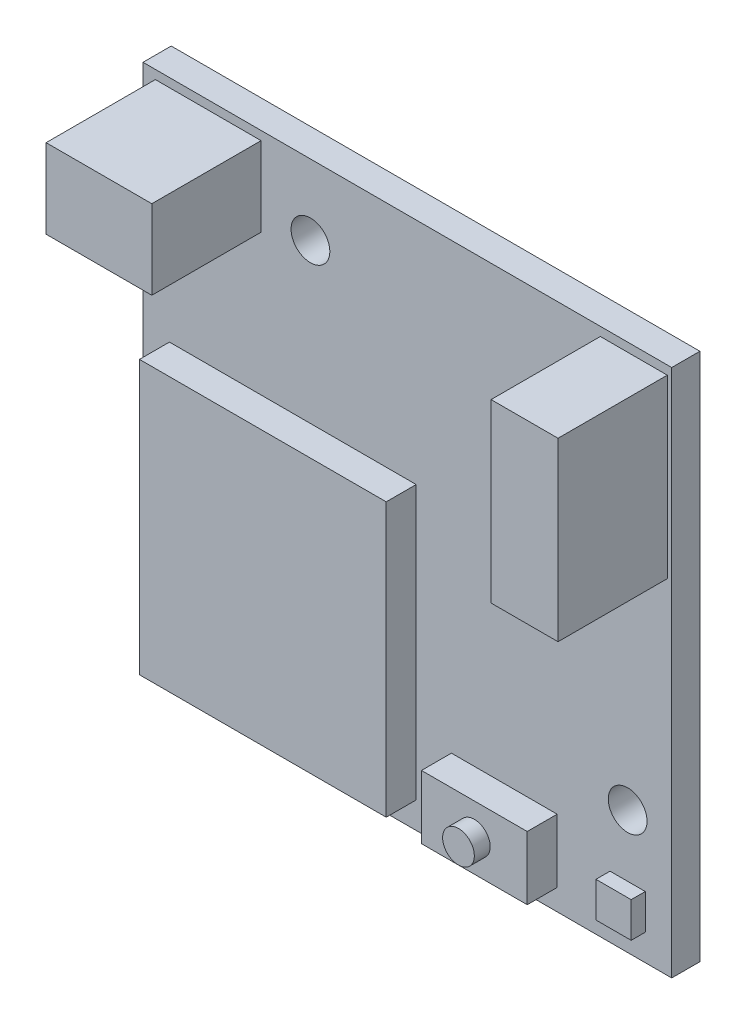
ISO-10303-21;
HEADER;
FILE_DESCRIPTION(('STEP AP214'),'2;1');
FILE_NAME('part.step','',(''),(''),'','','');
FILE_SCHEMA(('AUTOMOTIVE_DESIGN { 1 0 10303 214 1 1 1 1 }'));
ENDSEC;
DATA;
#1=APPLICATION_CONTEXT('core data for automotive mechanical design processes');
#2=APPLICATION_PROTOCOL_DEFINITION('international standard','automotive_design',2000,#1);
#3=PRODUCT_CONTEXT('',#1,'mechanical');
#4=PRODUCT('Part','Part','',(#3));
#5=PRODUCT_RELATED_PRODUCT_CATEGORY('part','',(#4));
#6=PRODUCT_DEFINITION_FORMATION('','',#4);
#7=PRODUCT_DEFINITION_CONTEXT('part definition',#1,'design');
#8=PRODUCT_DEFINITION('design','',#6,#7);
#9=PRODUCT_DEFINITION_SHAPE('','',#8);
#10=(LENGTH_UNIT() NAMED_UNIT(*) SI_UNIT(.MILLI.,.METRE.));
#11=(NAMED_UNIT(*) PLANE_ANGLE_UNIT() SI_UNIT($,.RADIAN.));
#12=(NAMED_UNIT(*) SI_UNIT($,.STERADIAN.) SOLID_ANGLE_UNIT());
#13=UNCERTAINTY_MEASURE_WITH_UNIT(LENGTH_MEASURE(1.E-05),#10,'distance_accuracy_value','');
#14=(GEOMETRIC_REPRESENTATION_CONTEXT(3) GLOBAL_UNCERTAINTY_ASSIGNED_CONTEXT((#13)) GLOBAL_UNIT_ASSIGNED_CONTEXT((#10,
#11,#12)) REPRESENTATION_CONTEXT('',''));
#15=CARTESIAN_POINT('',(0.,0.,0.));
#16=DIRECTION('',(0.,0.,1.));
#17=DIRECTION('',(1.,0.,0.));
#18=AXIS2_PLACEMENT_3D('',#15,#16,#17);
#19=CARTESIAN_POINT('',(0.,0.,1.6));
#20=DIRECTION('',(0.,0.,-1.));
#21=DIRECTION('',(-1.,0.,0.));
#22=AXIS2_PLACEMENT_3D('',#19,#20,#21);
#23=PLANE('',#22);
#24=DIRECTION('',(0.,-1.,0.));
#25=VECTOR('',#24,1.);
#26=CARTESIAN_POINT('',(-14.3,14.5,1.6));
#27=LINE('',#26,#25);
#28=CARTESIAN_POINT('',(-14.3,14.5,1.6));
#29=VERTEX_POINT('',#28);
#30=CARTESIAN_POINT('',(-14.3,10.,1.6));
#31=VERTEX_POINT('',#30);
#32=EDGE_CURVE('E217',#29,#31,#27,.T.);
#33=ORIENTED_EDGE('',*,*,#32,.F.);
#34=DIRECTION('',(-1.,0.,0.));
#35=VECTOR('',#34,1.);
#36=CARTESIAN_POINT('',(-14.3,14.5,1.6));
#37=LINE('',#36,#35);
#38=CARTESIAN_POINT('',(-8.3,14.5,1.6));
#39=VERTEX_POINT('',#38);
#40=EDGE_CURVE('E260',#39,#29,#37,.T.);
#41=ORIENTED_EDGE('',*,*,#40,.F.);
#42=DIRECTION('',(0.,1.,0.));
#43=VECTOR('',#42,1.);
#44=CARTESIAN_POINT('',(-8.3,14.5,1.6));
#45=LINE('',#44,#43);
#46=CARTESIAN_POINT('',(-8.3,10.,1.6));
#47=VERTEX_POINT('',#46);
#48=EDGE_CURVE('E277',#47,#39,#45,.T.);
#49=ORIENTED_EDGE('',*,*,#48,.F.);
#50=DIRECTION('',(1.,0.,0.));
#51=VECTOR('',#50,1.);
#52=CARTESIAN_POINT('',(-14.3,10.,1.6));
#53=LINE('',#52,#51);
#54=EDGE_CURVE('E273',#31,#47,#53,.T.);
#55=ORIENTED_EDGE('',*,*,#54,.F.);
#56=EDGE_LOOP('',(#33,#41,#49,#55));
#57=FACE_BOUND('',#56,.T.);
#58=DIRECTION('',(0.,-1.,0.));
#59=VECTOR('',#58,1.);
#60=CARTESIAN_POINT('',(11.5,-11.5,1.6));
#61=LINE('',#60,#59);
#62=CARTESIAN_POINT('',(11.5,-11.5,1.6));
#63=VERTEX_POINT('',#62);
#64=CARTESIAN_POINT('',(11.5,-13.5,1.6));
#65=VERTEX_POINT('',#64);
#66=EDGE_CURVE('E344',#63,#65,#61,.T.);
#67=ORIENTED_EDGE('',*,*,#66,.F.);
#68=DIRECTION('',(-1.,0.,0.));
#69=VECTOR('',#68,1.);
#70=CARTESIAN_POINT('',(11.5,-11.5,1.6));
#71=LINE('',#70,#69);
#72=CARTESIAN_POINT('',(13.5,-11.5,1.6));
#73=VERTEX_POINT('',#72);
#74=EDGE_CURVE('E350',#73,#63,#71,.T.);
#75=ORIENTED_EDGE('',*,*,#74,.F.);
#76=DIRECTION('',(0.,1.,0.));
#77=VECTOR('',#76,1.);
#78=CARTESIAN_POINT('',(13.5,-11.5,1.6));
#79=LINE('',#78,#77);
#80=CARTESIAN_POINT('',(13.5,-13.5,1.6));
#81=VERTEX_POINT('',#80);
#82=EDGE_CURVE('E367',#81,#73,#79,.T.);
#83=ORIENTED_EDGE('',*,*,#82,.F.);
#84=DIRECTION('',(1.,0.,0.));
#85=VECTOR('',#84,1.);
#86=CARTESIAN_POINT('',(11.5,-13.5,1.6));
#87=LINE('',#86,#85);
#88=EDGE_CURVE('E363',#65,#81,#87,.T.);
#89=ORIENTED_EDGE('',*,*,#88,.F.);
#90=EDGE_LOOP('',(#67,#75,#83,#89));
#91=FACE_BOUND('',#90,.T.);
#92=DIRECTION('',(0.,1.,0.));
#93=VECTOR('',#92,1.);
#94=CARTESIAN_POINT('',(15.,-15.,1.6));
#95=LINE('',#94,#93);
#96=CARTESIAN_POINT('',(15.,-15.,1.6));
#97=VERTEX_POINT('',#96);
#98=CARTESIAN_POINT('',(15.,15.,1.6));
#99=VERTEX_POINT('',#98);
#100=EDGE_CURVE('E455',#97,#99,#95,.T.);
#101=ORIENTED_EDGE('',*,*,#100,.T.);
#102=DIRECTION('',(-1.,0.,0.));
#103=VECTOR('',#102,1.);
#104=CARTESIAN_POINT('',(-15.,15.,1.6));
#105=LINE('',#104,#103);
#106=CARTESIAN_POINT('',(-15.,15.,1.6));
#107=VERTEX_POINT('',#106);
#108=EDGE_CURVE('E459',#99,#107,#105,.T.);
#109=ORIENTED_EDGE('',*,*,#108,.T.);
#110=DIRECTION('',(0.,-1.,0.));
#111=VECTOR('',#110,1.);
#112=CARTESIAN_POINT('',(-15.,-15.,1.6));
#113=LINE('',#112,#111);
#114=CARTESIAN_POINT('',(-15.,-15.,1.6));
#115=VERTEX_POINT('',#114);
#116=EDGE_CURVE('E463',#107,#115,#113,.T.);
#117=ORIENTED_EDGE('',*,*,#116,.T.);
#118=DIRECTION('',(1.,0.,0.));
#119=VECTOR('',#118,1.);
#120=CARTESIAN_POINT('',(-15.,-15.,1.6));
#121=LINE('',#120,#119);
#122=EDGE_CURVE('E466',#115,#97,#121,.T.);
#123=ORIENTED_EDGE('',*,*,#122,.T.);
#124=EDGE_LOOP('',(#101,#109,#117,#123));
#125=FACE_BOUND('',#124,.T.);
#126=CARTESIAN_POINT('',(12.5,-8.,1.6));
#127=DIRECTION('',(0.,0.,1.));
#128=DIRECTION('',(1.,0.,0.));
#129=AXIS2_PLACEMENT_3D('',#126,#127,#128);
#130=CIRCLE('',#129,1.1);
#131=CARTESIAN_POINT('',(13.6,-8.,1.6));
#132=VERTEX_POINT('',#131);
#133=EDGE_CURVE('E448',#132,#132,#130,.T.);
#134=ORIENTED_EDGE('',*,*,#133,.F.);
#135=EDGE_LOOP('',(#134));
#136=FACE_BOUND('',#135,.T.);
#137=CARTESIAN_POINT('',(-5.5,11.,1.6));
#138=DIRECTION('',(0.,0.,1.));
#139=DIRECTION('',(1.,0.,0.));
#140=AXIS2_PLACEMENT_3D('',#137,#138,#139);
#141=CIRCLE('',#140,1.1);
#142=CARTESIAN_POINT('',(-4.4,11.,1.6));
#143=VERTEX_POINT('',#142);
#144=EDGE_CURVE('E444',#143,#143,#141,.T.);
#145=ORIENTED_EDGE('',*,*,#144,.F.);
#146=EDGE_LOOP('',(#145));
#147=FACE_BOUND('',#146,.T.);
#148=DIRECTION('',(0.,-1.,0.));
#149=VECTOR('',#148,1.);
#150=CARTESIAN_POINT('',(2.5,-10.2,1.6));
#151=LINE('',#150,#149);
#152=CARTESIAN_POINT('',(2.5,-10.2,1.6));
#153=VERTEX_POINT('',#152);
#154=CARTESIAN_POINT('',(2.5,-13.8,1.6));
#155=VERTEX_POINT('',#154);
#156=EDGE_CURVE('E392',#153,#155,#151,.T.);
#157=ORIENTED_EDGE('',*,*,#156,.F.);
#158=DIRECTION('',(-1.,0.,0.));
#159=VECTOR('',#158,1.);
#160=CARTESIAN_POINT('',(2.5,-10.2,1.6));
#161=LINE('',#160,#159);
#162=CARTESIAN_POINT('',(8.5,-10.2,1.6));
#163=VERTEX_POINT('',#162);
#164=EDGE_CURVE('E399',#163,#153,#161,.T.);
#165=ORIENTED_EDGE('',*,*,#164,.F.);
#166=DIRECTION('',(0.,1.,0.));
#167=VECTOR('',#166,1.);
#168=CARTESIAN_POINT('',(8.5,-10.2,1.6));
#169=LINE('',#168,#167);
#170=CARTESIAN_POINT('',(8.5,-13.8,1.6));
#171=VERTEX_POINT('',#170);
#172=EDGE_CURVE('E416',#171,#163,#169,.T.);
#173=ORIENTED_EDGE('',*,*,#172,.F.);
#174=DIRECTION('',(1.,0.,0.));
#175=VECTOR('',#174,1.);
#176=CARTESIAN_POINT('',(2.5,-13.8,1.6));
#177=LINE('',#176,#175);
#178=EDGE_CURVE('E412',#155,#171,#177,.T.);
#179=ORIENTED_EDGE('',*,*,#178,.F.);
#180=EDGE_LOOP('',(#157,#165,#173,#179));
#181=FACE_BOUND('',#180,.T.);
#182=DIRECTION('',(0.,-1.,0.));
#183=VECTOR('',#182,1.);
#184=CARTESIAN_POINT('',(-13.5,2.,1.6));
#185=LINE('',#184,#183);
#186=CARTESIAN_POINT('',(-13.5,2.,1.6));
#187=VERTEX_POINT('',#186);
#188=CARTESIAN_POINT('',(-13.5,-13.5,1.6));
#189=VERTEX_POINT('',#188);
#190=EDGE_CURVE('E299',#187,#189,#185,.T.);
#191=ORIENTED_EDGE('',*,*,#190,.F.);
#192=DIRECTION('',(-1.,0.,0.));
#193=VECTOR('',#192,1.);
#194=CARTESIAN_POINT('',(-13.5,2.,1.6));
#195=LINE('',#194,#193);
#196=CARTESIAN_POINT('',(0.5,2.,1.6));
#197=VERTEX_POINT('',#196);
#198=EDGE_CURVE('E305',#197,#187,#195,.T.);
#199=ORIENTED_EDGE('',*,*,#198,.F.);
#200=DIRECTION('',(0.,1.,0.));
#201=VECTOR('',#200,1.);
#202=CARTESIAN_POINT('',(0.5,2.,1.6));
#203=LINE('',#202,#201);
#204=CARTESIAN_POINT('',(0.500000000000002,-13.5,1.6));
#205=VERTEX_POINT('',#204);
#206=EDGE_CURVE('E322',#205,#197,#203,.T.);
#207=ORIENTED_EDGE('',*,*,#206,.F.);
#208=DIRECTION('',(1.,0.,0.));
#209=VECTOR('',#208,1.);
#210=CARTESIAN_POINT('',(-13.5,-13.5,1.6));
#211=LINE('',#210,#209);
#212=EDGE_CURVE('E318',#189,#205,#211,.T.);
#213=ORIENTED_EDGE('',*,*,#212,.F.);
#214=EDGE_LOOP('',(#191,#199,#207,#213));
#215=FACE_BOUND('',#214,.T.);
#216=DIRECTION('',(0.,-1.,0.));
#217=VECTOR('',#216,1.);
#218=CARTESIAN_POINT('',(10.95,14.5,1.6));
#219=LINE('',#218,#217);
#220=CARTESIAN_POINT('',(10.95,14.5,1.6));
#221=VERTEX_POINT('',#220);
#222=CARTESIAN_POINT('',(10.95,4.5,1.6));
#223=VERTEX_POINT('',#222);
#224=EDGE_CURVE('E210',#221,#223,#219,.T.);
#225=ORIENTED_EDGE('',*,*,#224,.F.);
#226=DIRECTION('',(-1.,0.,0.));
#227=VECTOR('',#226,1.);
#228=CARTESIAN_POINT('',(10.95,14.5,1.6));
#229=LINE('',#228,#227);
#230=CARTESIAN_POINT('',(14.75,14.5,1.6));
#231=VERTEX_POINT('',#230);
#232=EDGE_CURVE('E212',#231,#221,#229,.T.);
#233=ORIENTED_EDGE('',*,*,#232,.F.);
#234=DIRECTION('',(0.,1.,0.));
#235=VECTOR('',#234,1.);
#236=CARTESIAN_POINT('',(14.75,14.5,1.6));
#237=LINE('',#236,#235);
#238=CARTESIAN_POINT('',(14.75,4.5,1.6));
#239=VERTEX_POINT('',#238);
#240=EDGE_CURVE('E73',#239,#231,#237,.T.);
#241=ORIENTED_EDGE('',*,*,#240,.F.);
#242=DIRECTION('',(1.,0.,0.));
#243=VECTOR('',#242,1.);
#244=CARTESIAN_POINT('',(10.95,4.5,1.6));
#245=LINE('',#244,#243);
#246=EDGE_CURVE('E68',#223,#239,#245,.T.);
#247=ORIENTED_EDGE('',*,*,#246,.F.);
#248=EDGE_LOOP('',(#225,#233,#241,#247));
#249=FACE_BOUND('',#248,.T.);
#250=ADVANCED_FACE('F51',(#57,#91,#125,#136,#147,#181,#215,#249),#23,.F.);
#251=CARTESIAN_POINT('',(15.,-15.,1.6));
#252=DIRECTION('',(-1.,0.,0.));
#253=DIRECTION('',(0.,0.,1.));
#254=AXIS2_PLACEMENT_3D('',#251,#252,#253);
#255=PLANE('',#254);
#256=DIRECTION('',(0.,1.,0.));
#257=VECTOR('',#256,1.);
#258=CARTESIAN_POINT('',(15.,-15.,0.));
#259=LINE('',#258,#257);
#260=CARTESIAN_POINT('',(15.,-15.,0.));
#261=VERTEX_POINT('',#260);
#262=CARTESIAN_POINT('',(15.,15.,0.));
#263=VERTEX_POINT('',#262);
#264=EDGE_CURVE('E443',#261,#263,#259,.T.);
#265=ORIENTED_EDGE('',*,*,#264,.T.);
#266=DIRECTION('',(0.,0.,-1.));
#267=VECTOR('',#266,1.);
#268=CARTESIAN_POINT('',(15.,15.,1.6));
#269=LINE('',#268,#267);
#270=EDGE_CURVE('E55',#99,#263,#269,.T.);
#271=ORIENTED_EDGE('',*,*,#270,.F.);
#272=ORIENTED_EDGE('',*,*,#100,.F.);
#273=DIRECTION('',(0.,0.,-1.));
#274=VECTOR('',#273,1.);
#275=CARTESIAN_POINT('',(15.,-15.,1.6));
#276=LINE('',#275,#274);
#277=EDGE_CURVE('E469',#97,#261,#276,.T.);
#278=ORIENTED_EDGE('',*,*,#277,.T.);
#279=EDGE_LOOP('',(#265,#271,#272,#278));
#280=FACE_BOUND('',#279,.T.);
#281=ADVANCED_FACE('F53',(#280),#255,.F.);
#282=CARTESIAN_POINT('',(-15.,15.,1.6));
#283=DIRECTION('',(0.,-1.,0.));
#284=DIRECTION('',(0.,0.,-1.));
#285=AXIS2_PLACEMENT_3D('',#282,#283,#284);
#286=PLANE('',#285);
#287=DIRECTION('',(-1.,0.,0.));
#288=VECTOR('',#287,1.);
#289=CARTESIAN_POINT('',(-15.,15.,0.));
#290=LINE('',#289,#288);
#291=CARTESIAN_POINT('',(-15.,15.,0.));
#292=VERTEX_POINT('',#291);
#293=EDGE_CURVE('E473',#263,#292,#290,.T.);
#294=ORIENTED_EDGE('',*,*,#293,.T.);
#295=DIRECTION('',(0.,0.,-1.));
#296=VECTOR('',#295,1.);
#297=CARTESIAN_POINT('',(-15.,15.,1.6));
#298=LINE('',#297,#296);
#299=EDGE_CURVE('E487',#107,#292,#298,.T.);
#300=ORIENTED_EDGE('',*,*,#299,.F.);
#301=ORIENTED_EDGE('',*,*,#108,.F.);
#302=ORIENTED_EDGE('',*,*,#270,.T.);
#303=EDGE_LOOP('',(#294,#300,#301,#302));
#304=FACE_BOUND('',#303,.T.);
#305=ADVANCED_FACE('F498',(#304),#286,.F.);
#306=CARTESIAN_POINT('',(-15.,-15.,1.6));
#307=DIRECTION('',(1.,0.,0.));
#308=DIRECTION('',(0.,0.,-1.));
#309=AXIS2_PLACEMENT_3D('',#306,#307,#308);
#310=PLANE('',#309);
#311=DIRECTION('',(0.,-1.,0.));
#312=VECTOR('',#311,1.);
#313=CARTESIAN_POINT('',(-15.,-15.,0.));
#314=LINE('',#313,#312);
#315=CARTESIAN_POINT('',(-15.,-15.,0.));
#316=VERTEX_POINT('',#315);
#317=EDGE_CURVE('E476',#292,#316,#314,.T.);
#318=ORIENTED_EDGE('',*,*,#317,.T.);
#319=DIRECTION('',(0.,0.,-1.));
#320=VECTOR('',#319,1.);
#321=CARTESIAN_POINT('',(-15.,-15.,1.6));
#322=LINE('',#321,#320);
#323=EDGE_CURVE('E484',#115,#316,#322,.T.);
#324=ORIENTED_EDGE('',*,*,#323,.F.);
#325=ORIENTED_EDGE('',*,*,#116,.F.);
#326=ORIENTED_EDGE('',*,*,#299,.T.);
#327=EDGE_LOOP('',(#318,#324,#325,#326));
#328=FACE_BOUND('',#327,.T.);
#329=ADVANCED_FACE('F507',(#328),#310,.F.);
#330=CARTESIAN_POINT('',(-15.,-15.,1.6));
#331=DIRECTION('',(0.,1.,0.));
#332=DIRECTION('',(0.,0.,1.));
#333=AXIS2_PLACEMENT_3D('',#330,#331,#332);
#334=PLANE('',#333);
#335=DIRECTION('',(1.,0.,0.));
#336=VECTOR('',#335,1.);
#337=CARTESIAN_POINT('',(-15.,-15.,0.));
#338=LINE('',#337,#336);
#339=EDGE_CURVE('E460',#316,#261,#338,.T.);
#340=ORIENTED_EDGE('',*,*,#339,.T.);
#341=ORIENTED_EDGE('',*,*,#277,.F.);
#342=ORIENTED_EDGE('',*,*,#122,.F.);
#343=ORIENTED_EDGE('',*,*,#323,.T.);
#344=EDGE_LOOP('',(#340,#341,#342,#343));
#345=FACE_BOUND('',#344,.T.);
#346=ADVANCED_FACE('F510',(#345),#334,.F.);
#347=CARTESIAN_POINT('',(0.,0.,0.));
#348=DIRECTION('',(0.,0.,-1.));
#349=DIRECTION('',(-1.,0.,0.));
#350=AXIS2_PLACEMENT_3D('',#347,#348,#349);
#351=PLANE('',#350);
#352=CARTESIAN_POINT('',(-5.5,11.,0.));
#353=DIRECTION('',(0.,0.,1.));
#354=DIRECTION('',(1.,0.,0.));
#355=AXIS2_PLACEMENT_3D('',#352,#353,#354);
#356=CIRCLE('',#355,1.1);
#357=CARTESIAN_POINT('',(-4.4,11.,0.));
#358=VERTEX_POINT('',#357);
#359=EDGE_CURVE('E439',#358,#358,#356,.T.);
#360=ORIENTED_EDGE('',*,*,#359,.T.);
#361=EDGE_LOOP('',(#360));
#362=FACE_BOUND('',#361,.T.);
#363=CARTESIAN_POINT('',(12.5,-8.,0.));
#364=DIRECTION('',(0.,0.,1.));
#365=DIRECTION('',(1.,0.,0.));
#366=AXIS2_PLACEMENT_3D('',#363,#364,#365);
#367=CIRCLE('',#366,1.1);
#368=CARTESIAN_POINT('',(13.6,-8.,0.));
#369=VERTEX_POINT('',#368);
#370=EDGE_CURVE('E438',#369,#369,#367,.T.);
#371=ORIENTED_EDGE('',*,*,#370,.T.);
#372=EDGE_LOOP('',(#371));
#373=FACE_BOUND('',#372,.T.);
#374=ORIENTED_EDGE('',*,*,#264,.F.);
#375=ORIENTED_EDGE('',*,*,#339,.F.);
#376=ORIENTED_EDGE('',*,*,#317,.F.);
#377=ORIENTED_EDGE('',*,*,#293,.F.);
#378=EDGE_LOOP('',(#374,#375,#376,#377));
#379=FACE_BOUND('',#378,.T.);
#380=ADVANCED_FACE('F505',(#362,#373,#379),#351,.T.);
#381=CARTESIAN_POINT('',(12.5,-8.,0.));
#382=DIRECTION('',(0.,0.,1.));
#383=DIRECTION('',(1.,0.,0.));
#384=AXIS2_PLACEMENT_3D('',#381,#382,#383);
#385=CYLINDRICAL_SURFACE('',#384,1.1);
#386=ORIENTED_EDGE('',*,*,#370,.F.);
#387=EDGE_LOOP('',(#386));
#388=FACE_BOUND('',#387,.T.);
#389=ORIENTED_EDGE('',*,*,#133,.T.);
#390=EDGE_LOOP('',(#389));
#391=FACE_BOUND('',#390,.T.);
#392=ADVANCED_FACE('F599',(#388,#391),#385,.F.);
#393=CARTESIAN_POINT('',(-5.5,11.,0.));
#394=DIRECTION('',(0.,0.,1.));
#395=DIRECTION('',(1.,0.,0.));
#396=AXIS2_PLACEMENT_3D('',#393,#394,#395);
#397=CYLINDRICAL_SURFACE('',#396,1.1);
#398=ORIENTED_EDGE('',*,*,#359,.F.);
#399=EDGE_LOOP('',(#398));
#400=FACE_BOUND('',#399,.T.);
#401=ORIENTED_EDGE('',*,*,#144,.T.);
#402=EDGE_LOOP('',(#401));
#403=FACE_BOUND('',#402,.T.);
#404=ADVANCED_FACE('F595',(#400,#403),#397,.F.);
#405=CARTESIAN_POINT('',(2.5,-10.2,3.3));
#406=DIRECTION('',(1.,0.,0.));
#407=DIRECTION('',(0.,1.,0.));
#408=AXIS2_PLACEMENT_3D('',#405,#406,#407);
#409=PLANE('',#408);
#410=ORIENTED_EDGE('',*,*,#156,.T.);
#411=DIRECTION('',(0.,0.,-1.));
#412=VECTOR('',#411,1.);
#413=CARTESIAN_POINT('',(2.5,-13.8,3.3));
#414=LINE('',#413,#412);
#415=CARTESIAN_POINT('',(2.5,-13.8,3.3));
#416=VERTEX_POINT('',#415);
#417=EDGE_CURVE('E434',#416,#155,#414,.T.);
#418=ORIENTED_EDGE('',*,*,#417,.F.);
#419=DIRECTION('',(0.,-1.,0.));
#420=VECTOR('',#419,1.);
#421=CARTESIAN_POINT('',(2.5,-10.2,3.3));
#422=LINE('',#421,#420);
#423=CARTESIAN_POINT('',(2.5,-10.2,3.3));
#424=VERTEX_POINT('',#423);
#425=EDGE_CURVE('E394',#424,#416,#422,.T.);
#426=ORIENTED_EDGE('',*,*,#425,.F.);
#427=DIRECTION('',(0.,0.,-1.));
#428=VECTOR('',#427,1.);
#429=CARTESIAN_POINT('',(2.5,-10.2,3.3));
#430=LINE('',#429,#428);
#431=EDGE_CURVE('E408',#424,#153,#430,.T.);
#432=ORIENTED_EDGE('',*,*,#431,.T.);
#433=EDGE_LOOP('',(#410,#418,#426,#432));
#434=FACE_BOUND('',#433,.T.);
#435=ADVANCED_FACE('F591',(#434),#409,.F.);
#436=CARTESIAN_POINT('',(2.5,-13.8,3.3));
#437=DIRECTION('',(0.,1.,0.));
#438=DIRECTION('',(0.,0.,1.));
#439=AXIS2_PLACEMENT_3D('',#436,#437,#438);
#440=PLANE('',#439);
#441=ORIENTED_EDGE('',*,*,#178,.T.);
#442=DIRECTION('',(0.,0.,-1.));
#443=VECTOR('',#442,1.);
#444=CARTESIAN_POINT('',(8.5,-13.8,3.3));
#445=LINE('',#444,#443);
#446=CARTESIAN_POINT('',(8.5,-13.8,3.3));
#447=VERTEX_POINT('',#446);
#448=EDGE_CURVE('E430',#447,#171,#445,.T.);
#449=ORIENTED_EDGE('',*,*,#448,.F.);
#450=DIRECTION('',(1.,0.,0.));
#451=VECTOR('',#450,1.);
#452=CARTESIAN_POINT('',(2.5,-13.8,3.3));
#453=LINE('',#452,#451);
#454=EDGE_CURVE('E398',#416,#447,#453,.T.);
#455=ORIENTED_EDGE('',*,*,#454,.F.);
#456=ORIENTED_EDGE('',*,*,#417,.T.);
#457=EDGE_LOOP('',(#441,#449,#455,#456));
#458=FACE_BOUND('',#457,.T.);
#459=ADVANCED_FACE('F587',(#458),#440,.F.);
#460=CARTESIAN_POINT('',(8.5,-10.2,3.3));
#461=DIRECTION('',(-1.,0.,0.));
#462=DIRECTION('',(0.,0.,1.));
#463=AXIS2_PLACEMENT_3D('',#460,#461,#462);
#464=PLANE('',#463);
#465=ORIENTED_EDGE('',*,*,#172,.T.);
#466=DIRECTION('',(0.,0.,-1.));
#467=VECTOR('',#466,1.);
#468=CARTESIAN_POINT('',(8.5,-10.2,3.3));
#469=LINE('',#468,#467);
#470=CARTESIAN_POINT('',(8.5,-10.2,3.3));
#471=VERTEX_POINT('',#470);
#472=EDGE_CURVE('E426',#471,#163,#469,.T.);
#473=ORIENTED_EDGE('',*,*,#472,.F.);
#474=DIRECTION('',(0.,1.,0.));
#475=VECTOR('',#474,1.);
#476=CARTESIAN_POINT('',(8.5,-10.2,3.3));
#477=LINE('',#476,#475);
#478=EDGE_CURVE('E402',#447,#471,#477,.T.);
#479=ORIENTED_EDGE('',*,*,#478,.F.);
#480=ORIENTED_EDGE('',*,*,#448,.T.);
#481=EDGE_LOOP('',(#465,#473,#479,#480));
#482=FACE_BOUND('',#481,.T.);
#483=ADVANCED_FACE('F583',(#482),#464,.F.);
#484=CARTESIAN_POINT('',(2.5,-10.2,3.3));
#485=DIRECTION('',(0.,-1.,0.));
#486=DIRECTION('',(0.,0.,-1.));
#487=AXIS2_PLACEMENT_3D('',#484,#485,#486);
#488=PLANE('',#487);
#489=ORIENTED_EDGE('',*,*,#164,.T.);
#490=ORIENTED_EDGE('',*,*,#431,.F.);
#491=DIRECTION('',(-1.,0.,0.));
#492=VECTOR('',#491,1.);
#493=CARTESIAN_POINT('',(2.5,-10.2,3.3));
#494=LINE('',#493,#492);
#495=EDGE_CURVE('E405',#471,#424,#494,.T.);
#496=ORIENTED_EDGE('',*,*,#495,.F.);
#497=ORIENTED_EDGE('',*,*,#472,.T.);
#498=EDGE_LOOP('',(#489,#490,#496,#497));
#499=FACE_BOUND('',#498,.T.);
#500=ADVANCED_FACE('F579',(#499),#488,.F.);
#501=CARTESIAN_POINT('',(0.,0.,3.3));
#502=DIRECTION('',(0.,0.,1.));
#503=DIRECTION('',(1.,0.,0.));
#504=AXIS2_PLACEMENT_3D('',#501,#502,#503);
#505=PLANE('',#504);
#506=CARTESIAN_POINT('',(5.5,-12.,3.3));
#507=DIRECTION('',(0.,0.,1.));
#508=DIRECTION('',(1.,0.,0.));
#509=AXIS2_PLACEMENT_3D('',#506,#507,#508);
#510=CIRCLE('',#509,0.899999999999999);
#511=CARTESIAN_POINT('',(6.4,-12.,3.3));
#512=VERTEX_POINT('',#511);
#513=EDGE_CURVE('E11',#512,#512,#510,.T.);
#514=ORIENTED_EDGE('',*,*,#513,.F.);
#515=EDGE_LOOP('',(#514));
#516=FACE_BOUND('',#515,.T.);
#517=ORIENTED_EDGE('',*,*,#425,.T.);
#518=ORIENTED_EDGE('',*,*,#454,.T.);
#519=ORIENTED_EDGE('',*,*,#478,.T.);
#520=ORIENTED_EDGE('',*,*,#495,.T.);
#521=EDGE_LOOP('',(#517,#518,#519,#520));
#522=FACE_BOUND('',#521,.T.);
#523=ADVANCED_FACE('F575',(#516,#522),#505,.T.);
#524=CARTESIAN_POINT('',(5.5,-12.,4.2));
#525=DIRECTION('',(0.,0.,-1.));
#526=DIRECTION('',(-1.,0.,0.));
#527=AXIS2_PLACEMENT_3D('',#524,#525,#526);
#528=CYLINDRICAL_SURFACE('',#527,0.899999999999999);
#529=CARTESIAN_POINT('',(5.5,-12.,4.2));
#530=DIRECTION('',(0.,0.,1.));
#531=DIRECTION('',(1.,0.,0.));
#532=AXIS2_PLACEMENT_3D('',#529,#530,#531);
#533=CIRCLE('',#532,0.899999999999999);
#534=CARTESIAN_POINT('',(6.4,-12.,4.2));
#535=VERTEX_POINT('',#534);
#536=EDGE_CURVE('E389',#535,#535,#533,.T.);
#537=ORIENTED_EDGE('',*,*,#536,.F.);
#538=EDGE_LOOP('',(#537));
#539=FACE_BOUND('',#538,.T.);
#540=ORIENTED_EDGE('',*,*,#513,.T.);
#541=EDGE_LOOP('',(#540));
#542=FACE_BOUND('',#541,.T.);
#543=ADVANCED_FACE('F571',(#539,#542),#528,.T.);
#544=CARTESIAN_POINT('',(5.5,-12.,4.2));
#545=DIRECTION('',(0.,0.,1.));
#546=DIRECTION('',(1.,0.,0.));
#547=AXIS2_PLACEMENT_3D('',#544,#545,#546);
#548=PLANE('',#547);
#549=ORIENTED_EDGE('',*,*,#536,.T.);
#550=EDGE_LOOP('',(#549));
#551=FACE_BOUND('',#550,.T.);
#552=ADVANCED_FACE('F567',(#551),#548,.T.);
#553=CARTESIAN_POINT('',(11.5,-11.5,2.4));
#554=DIRECTION('',(1.,0.,0.));
#555=DIRECTION('',(0.,0.,-1.));
#556=AXIS2_PLACEMENT_3D('',#553,#554,#555);
#557=PLANE('',#556);
#558=ORIENTED_EDGE('',*,*,#66,.T.);
#559=DIRECTION('',(0.,0.,-1.));
#560=VECTOR('',#559,1.);
#561=CARTESIAN_POINT('',(11.5,-13.5,2.4));
#562=LINE('',#561,#560);
#563=CARTESIAN_POINT('',(11.5,-13.5,2.4));
#564=VERTEX_POINT('',#563);
#565=EDGE_CURVE('E385',#564,#65,#562,.T.);
#566=ORIENTED_EDGE('',*,*,#565,.F.);
#567=DIRECTION('',(0.,-1.,0.));
#568=VECTOR('',#567,1.);
#569=CARTESIAN_POINT('',(11.5,-11.5,2.4));
#570=LINE('',#569,#568);
#571=CARTESIAN_POINT('',(11.5,-11.5,2.4));
#572=VERTEX_POINT('',#571);
#573=EDGE_CURVE('E345',#572,#564,#570,.T.);
#574=ORIENTED_EDGE('',*,*,#573,.F.);
#575=DIRECTION('',(0.,0.,-1.));
#576=VECTOR('',#575,1.);
#577=CARTESIAN_POINT('',(11.5,-11.5,2.4));
#578=LINE('',#577,#576);
#579=EDGE_CURVE('E359',#572,#63,#578,.T.);
#580=ORIENTED_EDGE('',*,*,#579,.T.);
#581=EDGE_LOOP('',(#558,#566,#574,#580));
#582=FACE_BOUND('',#581,.T.);
#583=ADVANCED_FACE('F563',(#582),#557,.F.);
#584=CARTESIAN_POINT('',(11.5,-13.5,2.4));
#585=DIRECTION('',(0.,1.,0.));
#586=DIRECTION('',(0.,0.,1.));
#587=AXIS2_PLACEMENT_3D('',#584,#585,#586);
#588=PLANE('',#587);
#589=ORIENTED_EDGE('',*,*,#88,.T.);
#590=DIRECTION('',(0.,0.,-1.));
#591=VECTOR('',#590,1.);
#592=CARTESIAN_POINT('',(13.5,-13.5,2.4));
#593=LINE('',#592,#591);
#594=CARTESIAN_POINT('',(13.5,-13.5,2.4));
#595=VERTEX_POINT('',#594);
#596=EDGE_CURVE('E381',#595,#81,#593,.T.);
#597=ORIENTED_EDGE('',*,*,#596,.F.);
#598=DIRECTION('',(1.,0.,0.));
#599=VECTOR('',#598,1.);
#600=CARTESIAN_POINT('',(11.5,-13.5,2.4));
#601=LINE('',#600,#599);
#602=EDGE_CURVE('E349',#564,#595,#601,.T.);
#603=ORIENTED_EDGE('',*,*,#602,.F.);
#604=ORIENTED_EDGE('',*,*,#565,.T.);
#605=EDGE_LOOP('',(#589,#597,#603,#604));
#606=FACE_BOUND('',#605,.T.);
#607=ADVANCED_FACE('F559',(#606),#588,.F.);
#608=CARTESIAN_POINT('',(13.5,-11.5,2.4));
#609=DIRECTION('',(-1.,0.,0.));
#610=DIRECTION('',(0.,0.,1.));
#611=AXIS2_PLACEMENT_3D('',#608,#609,#610);
#612=PLANE('',#611);
#613=ORIENTED_EDGE('',*,*,#82,.T.);
#614=DIRECTION('',(0.,0.,-1.));
#615=VECTOR('',#614,1.);
#616=CARTESIAN_POINT('',(13.5,-11.5,2.4));
#617=LINE('',#616,#615);
#618=CARTESIAN_POINT('',(13.5,-11.5,2.4));
#619=VERTEX_POINT('',#618);
#620=EDGE_CURVE('E377',#619,#73,#617,.T.);
#621=ORIENTED_EDGE('',*,*,#620,.F.);
#622=DIRECTION('',(0.,1.,0.));
#623=VECTOR('',#622,1.);
#624=CARTESIAN_POINT('',(13.5,-11.5,2.4));
#625=LINE('',#624,#623);
#626=EDGE_CURVE('E353',#595,#619,#625,.T.);
#627=ORIENTED_EDGE('',*,*,#626,.F.);
#628=ORIENTED_EDGE('',*,*,#596,.T.);
#629=EDGE_LOOP('',(#613,#621,#627,#628));
#630=FACE_BOUND('',#629,.T.);
#631=ADVANCED_FACE('F555',(#630),#612,.F.);
#632=CARTESIAN_POINT('',(11.5,-11.5,2.4));
#633=DIRECTION('',(0.,-1.,0.));
#634=DIRECTION('',(0.,0.,-1.));
#635=AXIS2_PLACEMENT_3D('',#632,#633,#634);
#636=PLANE('',#635);
#637=ORIENTED_EDGE('',*,*,#74,.T.);
#638=ORIENTED_EDGE('',*,*,#579,.F.);
#639=DIRECTION('',(-1.,0.,0.));
#640=VECTOR('',#639,1.);
#641=CARTESIAN_POINT('',(11.5,-11.5,2.4));
#642=LINE('',#641,#640);
#643=EDGE_CURVE('E356',#619,#572,#642,.T.);
#644=ORIENTED_EDGE('',*,*,#643,.F.);
#645=ORIENTED_EDGE('',*,*,#620,.T.);
#646=EDGE_LOOP('',(#637,#638,#644,#645));
#647=FACE_BOUND('',#646,.T.);
#648=ADVANCED_FACE('F551',(#647),#636,.F.);
#649=CARTESIAN_POINT('',(0.,0.,2.4));
#650=DIRECTION('',(0.,0.,1.));
#651=DIRECTION('',(1.,0.,0.));
#652=AXIS2_PLACEMENT_3D('',#649,#650,#651);
#653=PLANE('',#652);
#654=ORIENTED_EDGE('',*,*,#573,.T.);
#655=ORIENTED_EDGE('',*,*,#602,.T.);
#656=ORIENTED_EDGE('',*,*,#626,.T.);
#657=ORIENTED_EDGE('',*,*,#643,.T.);
#658=EDGE_LOOP('',(#654,#655,#656,#657));
#659=FACE_BOUND('',#658,.T.);
#660=ADVANCED_FACE('F545',(#659),#653,.T.);
#661=CARTESIAN_POINT('',(-13.5,2.,3.3));
#662=DIRECTION('',(1.,0.,0.));
#663=DIRECTION('',(0.,1.,0.));
#664=AXIS2_PLACEMENT_3D('',#661,#662,#663);
#665=PLANE('',#664);
#666=ORIENTED_EDGE('',*,*,#190,.T.);
#667=DIRECTION('',(0.,0.,-1.));
#668=VECTOR('',#667,1.);
#669=CARTESIAN_POINT('',(-13.5,-13.5,3.3));
#670=LINE('',#669,#668);
#671=CARTESIAN_POINT('',(-13.5,-13.5,3.3));
#672=VERTEX_POINT('',#671);
#673=EDGE_CURVE('E340',#672,#189,#670,.T.);
#674=ORIENTED_EDGE('',*,*,#673,.F.);
#675=DIRECTION('',(0.,-1.,0.));
#676=VECTOR('',#675,1.);
#677=CARTESIAN_POINT('',(-13.5,2.,3.3));
#678=LINE('',#677,#676);
#679=CARTESIAN_POINT('',(-13.5,2.,3.3));
#680=VERTEX_POINT('',#679);
#681=EDGE_CURVE('E300',#680,#672,#678,.T.);
#682=ORIENTED_EDGE('',*,*,#681,.F.);
#683=DIRECTION('',(0.,0.,-1.));
#684=VECTOR('',#683,1.);
#685=CARTESIAN_POINT('',(-13.5,2.,3.3));
#686=LINE('',#685,#684);
#687=EDGE_CURVE('E314',#680,#187,#686,.T.);
#688=ORIENTED_EDGE('',*,*,#687,.T.);
#689=EDGE_LOOP('',(#666,#674,#682,#688));
#690=FACE_BOUND('',#689,.T.);
#691=ADVANCED_FACE('F529',(#690),#665,.F.);
#692=CARTESIAN_POINT('',(-13.5,-13.5,3.3));
#693=DIRECTION('',(0.,1.,0.));
#694=DIRECTION('',(0.,0.,1.));
#695=AXIS2_PLACEMENT_3D('',#692,#693,#694);
#696=PLANE('',#695);
#697=ORIENTED_EDGE('',*,*,#212,.T.);
#698=DIRECTION('',(0.,0.,-1.));
#699=VECTOR('',#698,1.);
#700=CARTESIAN_POINT('',(0.500000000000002,-13.5,3.3));
#701=LINE('',#700,#699);
#702=CARTESIAN_POINT('',(0.500000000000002,-13.5,3.3));
#703=VERTEX_POINT('',#702);
#704=EDGE_CURVE('E336',#703,#205,#701,.T.);
#705=ORIENTED_EDGE('',*,*,#704,.F.);
#706=DIRECTION('',(1.,0.,0.));
#707=VECTOR('',#706,1.);
#708=CARTESIAN_POINT('',(-13.5,-13.5,3.3));
#709=LINE('',#708,#707);
#710=EDGE_CURVE('E304',#672,#703,#709,.T.);
#711=ORIENTED_EDGE('',*,*,#710,.F.);
#712=ORIENTED_EDGE('',*,*,#673,.T.);
#713=EDGE_LOOP('',(#697,#705,#711,#712));
#714=FACE_BOUND('',#713,.T.);
#715=ADVANCED_FACE('F537',(#714),#696,.F.);
#716=CARTESIAN_POINT('',(0.5,2.,3.3));
#717=DIRECTION('',(-1.,0.,0.));
#718=DIRECTION('',(0.,-1.,0.));
#719=AXIS2_PLACEMENT_3D('',#716,#717,#718);
#720=PLANE('',#719);
#721=ORIENTED_EDGE('',*,*,#206,.T.);
#722=DIRECTION('',(0.,0.,-1.));
#723=VECTOR('',#722,1.);
#724=CARTESIAN_POINT('',(0.5,2.,3.3));
#725=LINE('',#724,#723);
#726=CARTESIAN_POINT('',(0.5,2.,3.3));
#727=VERTEX_POINT('',#726);
#728=EDGE_CURVE('E332',#727,#197,#725,.T.);
#729=ORIENTED_EDGE('',*,*,#728,.F.);
#730=DIRECTION('',(0.,1.,0.));
#731=VECTOR('',#730,1.);
#732=CARTESIAN_POINT('',(0.5,2.,3.3));
#733=LINE('',#732,#731);
#734=EDGE_CURVE('E308',#703,#727,#733,.T.);
#735=ORIENTED_EDGE('',*,*,#734,.F.);
#736=ORIENTED_EDGE('',*,*,#704,.T.);
#737=EDGE_LOOP('',(#721,#729,#735,#736));
#738=FACE_BOUND('',#737,.T.);
#739=ADVANCED_FACE('F535',(#738),#720,.F.);
#740=CARTESIAN_POINT('',(-13.5,2.,3.3));
#741=DIRECTION('',(0.,-1.,0.));
#742=DIRECTION('',(0.,0.,-1.));
#743=AXIS2_PLACEMENT_3D('',#740,#741,#742);
#744=PLANE('',#743);
#745=ORIENTED_EDGE('',*,*,#198,.T.);
#746=ORIENTED_EDGE('',*,*,#687,.F.);
#747=DIRECTION('',(-1.,0.,0.));
#748=VECTOR('',#747,1.);
#749=CARTESIAN_POINT('',(-13.5,2.,3.3));
#750=LINE('',#749,#748);
#751=EDGE_CURVE('E311',#727,#680,#750,.T.);
#752=ORIENTED_EDGE('',*,*,#751,.F.);
#753=ORIENTED_EDGE('',*,*,#728,.T.);
#754=EDGE_LOOP('',(#745,#746,#752,#753));
#755=FACE_BOUND('',#754,.T.);
#756=ADVANCED_FACE('F525',(#755),#744,.F.);
#757=CARTESIAN_POINT('',(0.,0.,3.3));
#758=DIRECTION('',(0.,0.,1.));
#759=DIRECTION('',(1.,0.,0.));
#760=AXIS2_PLACEMENT_3D('',#757,#758,#759);
#761=PLANE('',#760);
#762=ORIENTED_EDGE('',*,*,#681,.T.);
#763=ORIENTED_EDGE('',*,*,#710,.T.);
#764=ORIENTED_EDGE('',*,*,#734,.T.);
#765=ORIENTED_EDGE('',*,*,#751,.T.);
#766=EDGE_LOOP('',(#762,#763,#764,#765));
#767=FACE_BOUND('',#766,.T.);
#768=ADVANCED_FACE('F531',(#767),#761,.T.);
#769=CARTESIAN_POINT('',(-14.3,14.5,7.8));
#770=DIRECTION('',(1.,0.,0.));
#771=DIRECTION('',(0.,0.,-1.));
#772=AXIS2_PLACEMENT_3D('',#769,#770,#771);
#773=PLANE('',#772);
#774=ORIENTED_EDGE('',*,*,#32,.T.);
#775=DIRECTION('',(0.,0.,-1.));
#776=VECTOR('',#775,1.);
#777=CARTESIAN_POINT('',(-14.3,10.,7.8));
#778=LINE('',#777,#776);
#779=CARTESIAN_POINT('',(-14.3,10.,7.8));
#780=VERTEX_POINT('',#779);
#781=EDGE_CURVE('E295',#780,#31,#778,.T.);
#782=ORIENTED_EDGE('',*,*,#781,.F.);
#783=DIRECTION('',(0.,-1.,0.));
#784=VECTOR('',#783,1.);
#785=CARTESIAN_POINT('',(-14.3,14.5,7.8));
#786=LINE('',#785,#784);
#787=CARTESIAN_POINT('',(-14.3,14.5,7.8));
#788=VERTEX_POINT('',#787);
#789=EDGE_CURVE('E255',#788,#780,#786,.T.);
#790=ORIENTED_EDGE('',*,*,#789,.F.);
#791=DIRECTION('',(0.,0.,-1.));
#792=VECTOR('',#791,1.);
#793=CARTESIAN_POINT('',(-14.3,14.5,7.8));
#794=LINE('',#793,#792);
#795=EDGE_CURVE('E269',#788,#29,#794,.T.);
#796=ORIENTED_EDGE('',*,*,#795,.T.);
#797=EDGE_LOOP('',(#774,#782,#790,#796));
#798=FACE_BOUND('',#797,.T.);
#799=ADVANCED_FACE('F634',(#798),#773,.F.);
#800=CARTESIAN_POINT('',(-14.3,10.,7.8));
#801=DIRECTION('',(0.,1.,0.));
#802=DIRECTION('',(0.,0.,1.));
#803=AXIS2_PLACEMENT_3D('',#800,#801,#802);
#804=PLANE('',#803);
#805=ORIENTED_EDGE('',*,*,#54,.T.);
#806=DIRECTION('',(0.,0.,-1.));
#807=VECTOR('',#806,1.);
#808=CARTESIAN_POINT('',(-8.3,10.,7.8));
#809=LINE('',#808,#807);
#810=CARTESIAN_POINT('',(-8.3,10.,7.8));
#811=VERTEX_POINT('',#810);
#812=EDGE_CURVE('E291',#811,#47,#809,.T.);
#813=ORIENTED_EDGE('',*,*,#812,.F.);
#814=DIRECTION('',(1.,0.,0.));
#815=VECTOR('',#814,1.);
#816=CARTESIAN_POINT('',(-14.3,10.,7.8));
#817=LINE('',#816,#815);
#818=EDGE_CURVE('E259',#780,#811,#817,.T.);
#819=ORIENTED_EDGE('',*,*,#818,.F.);
#820=ORIENTED_EDGE('',*,*,#781,.T.);
#821=EDGE_LOOP('',(#805,#813,#819,#820));
#822=FACE_BOUND('',#821,.T.);
#823=ADVANCED_FACE('F640',(#822),#804,.F.);
#824=CARTESIAN_POINT('',(-8.3,14.5,7.8));
#825=DIRECTION('',(-1.,0.,0.));
#826=DIRECTION('',(0.,-1.,0.));
#827=AXIS2_PLACEMENT_3D('',#824,#825,#826);
#828=PLANE('',#827);
#829=ORIENTED_EDGE('',*,*,#48,.T.);
#830=DIRECTION('',(0.,0.,-1.));
#831=VECTOR('',#830,1.);
#832=CARTESIAN_POINT('',(-8.3,14.5,7.8));
#833=LINE('',#832,#831);
#834=CARTESIAN_POINT('',(-8.3,14.5,7.8));
#835=VERTEX_POINT('',#834);
#836=EDGE_CURVE('E287',#835,#39,#833,.T.);
#837=ORIENTED_EDGE('',*,*,#836,.F.);
#838=DIRECTION('',(0.,1.,0.));
#839=VECTOR('',#838,1.);
#840=CARTESIAN_POINT('',(-8.3,14.5,7.8));
#841=LINE('',#840,#839);
#842=EDGE_CURVE('E263',#811,#835,#841,.T.);
#843=ORIENTED_EDGE('',*,*,#842,.F.);
#844=ORIENTED_EDGE('',*,*,#812,.T.);
#845=EDGE_LOOP('',(#829,#837,#843,#844));
#846=FACE_BOUND('',#845,.T.);
#847=ADVANCED_FACE('F651',(#846),#828,.F.);
#848=CARTESIAN_POINT('',(-14.3,14.5,7.8));
#849=DIRECTION('',(0.,-1.,0.));
#850=DIRECTION('',(0.,0.,-1.));
#851=AXIS2_PLACEMENT_3D('',#848,#849,#850);
#852=PLANE('',#851);
#853=ORIENTED_EDGE('',*,*,#40,.T.);
#854=ORIENTED_EDGE('',*,*,#795,.F.);
#855=DIRECTION('',(-1.,0.,0.));
#856=VECTOR('',#855,1.);
#857=CARTESIAN_POINT('',(-14.3,14.5,7.8));
#858=LINE('',#857,#856);
#859=EDGE_CURVE('E266',#835,#788,#858,.T.);
#860=ORIENTED_EDGE('',*,*,#859,.F.);
#861=ORIENTED_EDGE('',*,*,#836,.T.);
#862=EDGE_LOOP('',(#853,#854,#860,#861));
#863=FACE_BOUND('',#862,.T.);
#864=ADVANCED_FACE('F663',(#863),#852,.F.);
#865=CARTESIAN_POINT('',(0.,0.,7.8));
#866=DIRECTION('',(0.,0.,1.));
#867=DIRECTION('',(1.,0.,0.));
#868=AXIS2_PLACEMENT_3D('',#865,#866,#867);
#869=PLANE('',#868);
#870=ORIENTED_EDGE('',*,*,#789,.T.);
#871=ORIENTED_EDGE('',*,*,#818,.T.);
#872=ORIENTED_EDGE('',*,*,#842,.T.);
#873=ORIENTED_EDGE('',*,*,#859,.T.);
#874=EDGE_LOOP('',(#870,#871,#872,#873));
#875=FACE_BOUND('',#874,.T.);
#876=ADVANCED_FACE('F675',(#875),#869,.T.);
#877=CARTESIAN_POINT('',(10.95,14.5,7.8));
#878=DIRECTION('',(1.,0.,0.));
#879=DIRECTION('',(0.,1.,0.));
#880=AXIS2_PLACEMENT_3D('',#877,#878,#879);
#881=PLANE('',#880);
#882=ORIENTED_EDGE('',*,*,#224,.T.);
#883=DIRECTION('',(0.,0.,-1.));
#884=VECTOR('',#883,1.);
#885=CARTESIAN_POINT('',(10.95,4.5,7.8));
#886=LINE('',#885,#884);
#887=CARTESIAN_POINT('',(10.95,4.5,7.8));
#888=VERTEX_POINT('',#887);
#889=EDGE_CURVE('E992',#888,#223,#886,.T.);
#890=ORIENTED_EDGE('',*,*,#889,.F.);
#891=DIRECTION('',(0.,-1.,0.));
#892=VECTOR('',#891,1.);
#893=CARTESIAN_POINT('',(10.95,14.5,7.8));
#894=LINE('',#893,#892);
#895=CARTESIAN_POINT('',(10.95,14.5,7.8));
#896=VERTEX_POINT('',#895);
#897=EDGE_CURVE('E229',#896,#888,#894,.T.);
#898=ORIENTED_EDGE('',*,*,#897,.F.);
#899=DIRECTION('',(0.,0.,-1.));
#900=VECTOR('',#899,1.);
#901=CARTESIAN_POINT('',(10.95,14.5,7.8));
#902=LINE('',#901,#900);
#903=EDGE_CURVE('E224',#896,#221,#902,.T.);
#904=ORIENTED_EDGE('',*,*,#903,.T.);
#905=EDGE_LOOP('',(#882,#890,#898,#904));
#906=FACE_BOUND('',#905,.T.);
#907=ADVANCED_FACE('F231',(#906),#881,.F.);
#908=CARTESIAN_POINT('',(10.95,4.5,7.8));
#909=DIRECTION('',(0.,1.,0.));
#910=DIRECTION('',(0.,0.,1.));
#911=AXIS2_PLACEMENT_3D('',#908,#909,#910);
#912=PLANE('',#911);
#913=ORIENTED_EDGE('',*,*,#246,.T.);
#914=DIRECTION('',(0.,0.,-1.));
#915=VECTOR('',#914,1.);
#916=CARTESIAN_POINT('',(14.75,4.5,7.8));
#917=LINE('',#916,#915);
#918=CARTESIAN_POINT('',(14.75,4.5,7.8));
#919=VERTEX_POINT('',#918);
#920=EDGE_CURVE('E240',#919,#239,#917,.T.);
#921=ORIENTED_EDGE('',*,*,#920,.F.);
#922=DIRECTION('',(1.,0.,0.));
#923=VECTOR('',#922,1.);
#924=CARTESIAN_POINT('',(10.95,4.5,7.8));
#925=LINE('',#924,#923);
#926=EDGE_CURVE('E250',#888,#919,#925,.T.);
#927=ORIENTED_EDGE('',*,*,#926,.F.);
#928=ORIENTED_EDGE('',*,*,#889,.T.);
#929=EDGE_LOOP('',(#913,#921,#927,#928));
#930=FACE_BOUND('',#929,.T.);
#931=ADVANCED_FACE('F698',(#930),#912,.F.);
#932=CARTESIAN_POINT('',(14.75,14.5,7.8));
#933=DIRECTION('',(-1.,0.,0.));
#934=DIRECTION('',(0.,-1.,0.));
#935=AXIS2_PLACEMENT_3D('',#932,#933,#934);
#936=PLANE('',#935);
#937=ORIENTED_EDGE('',*,*,#240,.T.);
#938=DIRECTION('',(0.,0.,-1.));
#939=VECTOR('',#938,1.);
#940=CARTESIAN_POINT('',(14.75,14.5,7.8));
#941=LINE('',#940,#939);
#942=CARTESIAN_POINT('',(14.75,14.5,7.8));
#943=VERTEX_POINT('',#942);
#944=EDGE_CURVE('E227',#943,#231,#941,.T.);
#945=ORIENTED_EDGE('',*,*,#944,.F.);
#946=DIRECTION('',(0.,1.,0.));
#947=VECTOR('',#946,1.);
#948=CARTESIAN_POINT('',(14.75,14.5,7.8));
#949=LINE('',#948,#947);
#950=EDGE_CURVE('E238',#919,#943,#949,.T.);
#951=ORIENTED_EDGE('',*,*,#950,.F.);
#952=ORIENTED_EDGE('',*,*,#920,.T.);
#953=EDGE_LOOP('',(#937,#945,#951,#952));
#954=FACE_BOUND('',#953,.T.);
#955=ADVANCED_FACE('F709',(#954),#936,.F.);
#956=CARTESIAN_POINT('',(10.95,14.5,7.8));
#957=DIRECTION('',(0.,-1.,0.));
#958=DIRECTION('',(0.,0.,-1.));
#959=AXIS2_PLACEMENT_3D('',#956,#957,#958);
#960=PLANE('',#959);
#961=ORIENTED_EDGE('',*,*,#232,.T.);
#962=ORIENTED_EDGE('',*,*,#903,.F.);
#963=DIRECTION('',(-1.,0.,0.));
#964=VECTOR('',#963,1.);
#965=CARTESIAN_POINT('',(10.95,14.5,7.8));
#966=LINE('',#965,#964);
#967=EDGE_CURVE('E234',#943,#896,#966,.T.);
#968=ORIENTED_EDGE('',*,*,#967,.F.);
#969=ORIENTED_EDGE('',*,*,#944,.T.);
#970=EDGE_LOOP('',(#961,#962,#968,#969));
#971=FACE_BOUND('',#970,.T.);
#972=ADVANCED_FACE('F222',(#971),#960,.F.);
#973=CARTESIAN_POINT('',(0.,0.,7.8));
#974=DIRECTION('',(0.,0.,1.));
#975=DIRECTION('',(1.,0.,0.));
#976=AXIS2_PLACEMENT_3D('',#973,#974,#975);
#977=PLANE('',#976);
#978=ORIENTED_EDGE('',*,*,#897,.T.);
#979=ORIENTED_EDGE('',*,*,#926,.T.);
#980=ORIENTED_EDGE('',*,*,#950,.T.);
#981=ORIENTED_EDGE('',*,*,#967,.T.);
#982=EDGE_LOOP('',(#978,#979,#980,#981));
#983=FACE_BOUND('',#982,.T.);
#984=ADVANCED_FACE('F732',(#983),#977,.T.);
#985=CLOSED_SHELL('',(#250,#281,#305,#329,#346,#380,#392,#404,#435,#459,#483,#500,#523,#543,
#552,#583,#607,#631,#648,#660,#691,#715,#739,#756,#768,#799,#823,#847,#864,#876,#907,#931,#955,
#972,#984));
#986=MANIFOLD_SOLID_BREP('B2',#985);
#987=ADVANCED_BREP_SHAPE_REPRESENTATION('',(#18,#986),#14);
#988=SHAPE_DEFINITION_REPRESENTATION(#9,#987);
ENDSEC;
END-ISO-10303-21;
